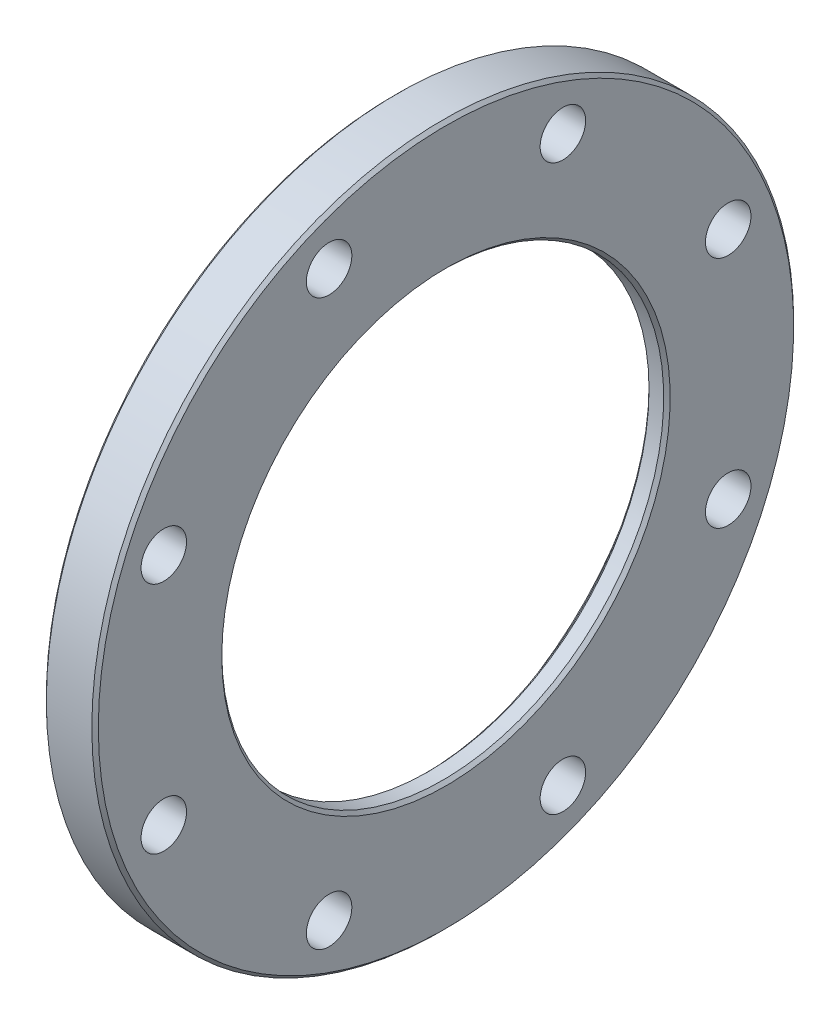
from build123d import *

# Parameters (mm, degrees)
CIRPATTERN1_COUNT = 8
CHAMFER1_SIZE     = 1.5875


with BuildPart() as part:
    # Sketch1 → Revolve1 (revolve)
    with BuildSketch(Plane(origin=(0, 0, 0), x_dir=(1, 0, 0), z_dir=(0, 1, 0)), mode=Mode.PRIVATE) as revolve1_sk:
        Polygon((0, 171.45), (0, 128.5875), (15.0622, 128.5875), (15.0622, 107.95), (25.4, 107.95), (25.4, 171.45), align=None)
    revolve(revolve1_sk.sketch.rotate(Axis((0, 0, 0), (1, 0, 0)), 180), axis=Axis((0, 0, 0), (1, 0, 0)))

    # Sketch2 → 7_8 _0.875_ Diameter Hole1 (revolve, cut)
    with BuildSketch(Plane(origin=(25.4, 57.105935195, 137.865923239), x_dir=(0, 0, -1), z_dir=(0, 1, 0))):
        Polygon((0, 0), (0, 82.877063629), (11.1125, 76.2), (11.1125, 0), align=None)
    f_7_8_0_875_diameter_hole1 = revolve(axis=Axis((31.75, 57.105935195, 137.865923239), (-1, 0, 0)), mode=Mode.SUBTRACT)

    # CirPattern1: 7_8 _0.875_ Diameter Hole1 ×8 about axis
    cirpattern1_axis = Axis((0, 0, 0), (1, 0, 0))
    for i in range(1, CIRPATTERN1_COUNT):
        add(f_7_8_0_875_diameter_hole1.rotate(cirpattern1_axis, i * 360 / CIRPATTERN1_COUNT), mode=Mode.SUBTRACT)

    # Chamfer1
    chamfer1_edges = [part.edges().sort_by_distance(p)[0] for p in [
        (25.4, 0, -171.45),
        (25.4, 0, -107.95),
        (15.0622, 0, -107.95),
        (0, 0, -128.5875),
        (0, 0, -171.45),
    ]]
    chamfer(chamfer1_edges, length=CHAMFER1_SIZE)


solid = part.part
